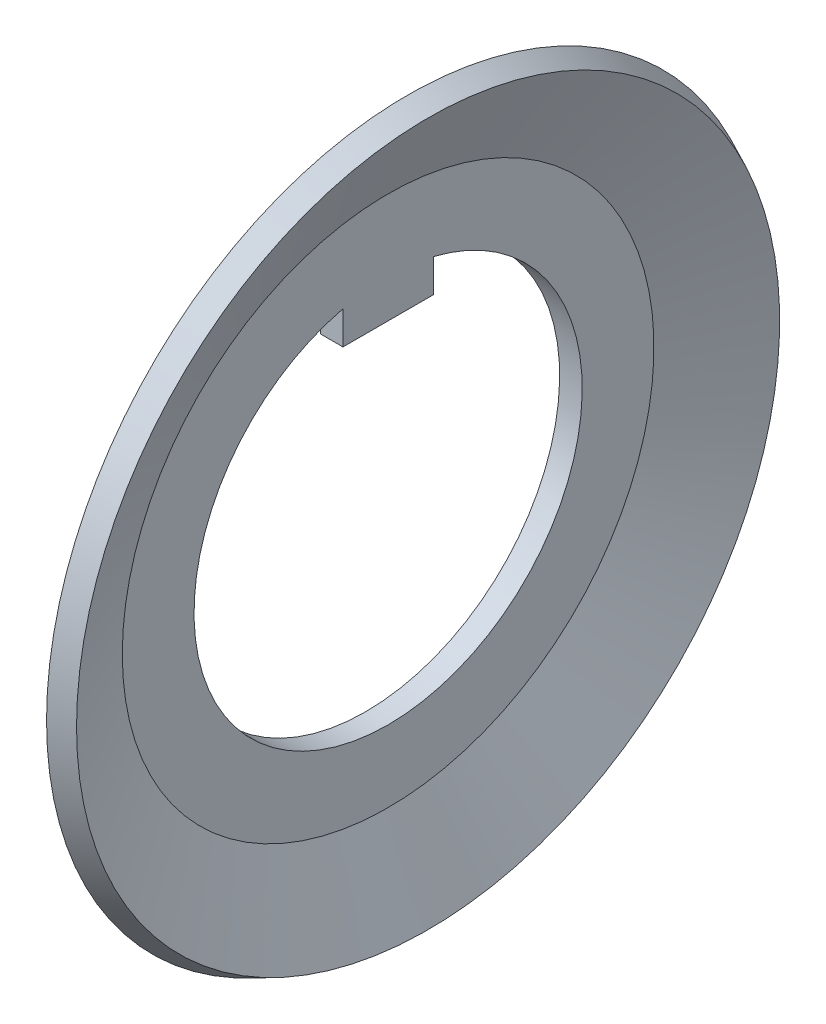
ISO-10303-21;
HEADER;
FILE_DESCRIPTION(('STEP AP214'),'2;1');
FILE_NAME('part.step','',(''),(''),'','','');
FILE_SCHEMA(('AUTOMOTIVE_DESIGN { 1 0 10303 214 1 1 1 1 }'));
ENDSEC;
DATA;
#1=APPLICATION_CONTEXT('core data for automotive mechanical design processes');
#2=APPLICATION_PROTOCOL_DEFINITION('international standard','automotive_design',2000,#1);
#3=PRODUCT_CONTEXT('',#1,'mechanical');
#4=PRODUCT('Part','Part','',(#3));
#5=PRODUCT_RELATED_PRODUCT_CATEGORY('part','',(#4));
#6=PRODUCT_DEFINITION_FORMATION('','',#4);
#7=PRODUCT_DEFINITION_CONTEXT('part definition',#1,'design');
#8=PRODUCT_DEFINITION('design','',#6,#7);
#9=PRODUCT_DEFINITION_SHAPE('','',#8);
#10=(LENGTH_UNIT() NAMED_UNIT(*) SI_UNIT(.MILLI.,.METRE.));
#11=(NAMED_UNIT(*) PLANE_ANGLE_UNIT() SI_UNIT($,.RADIAN.));
#12=(NAMED_UNIT(*) SI_UNIT($,.STERADIAN.) SOLID_ANGLE_UNIT());
#13=UNCERTAINTY_MEASURE_WITH_UNIT(LENGTH_MEASURE(1.E-05),#10,'distance_accuracy_value','');
#14=(GEOMETRIC_REPRESENTATION_CONTEXT(3) GLOBAL_UNCERTAINTY_ASSIGNED_CONTEXT((#13)) GLOBAL_UNIT_ASSIGNED_CONTEXT((#10,
#11,#12)) REPRESENTATION_CONTEXT('',''));
#15=CARTESIAN_POINT('',(0.,0.,0.));
#16=DIRECTION('',(0.,0.,1.));
#17=DIRECTION('',(1.,0.,0.));
#18=AXIS2_PLACEMENT_3D('',#15,#16,#17);
#19=CARTESIAN_POINT('',(0.,0.,0.));
#20=DIRECTION('',(-1.,0.,0.));
#21=DIRECTION('',(0.,0.,1.));
#22=AXIS2_PLACEMENT_3D('',#19,#20,#21);
#23=CYLINDRICAL_SURFACE('',#22,8.6);
#24=CARTESIAN_POINT('',(1.,0.,0.));
#25=DIRECTION('',(-1.,0.,0.));
#26=DIRECTION('',(0.,0.,1.));
#27=AXIS2_PLACEMENT_3D('',#24,#25,#26);
#28=CIRCLE('',#27,8.6);
#29=CARTESIAN_POINT('',(1.,8.36420946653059,-2.));
#30=VERTEX_POINT('',#29);
#31=CARTESIAN_POINT('',(1.,8.36420946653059,2.));
#32=VERTEX_POINT('',#31);
#33=EDGE_CURVE('E11',#30,#32,#28,.T.);
#34=ORIENTED_EDGE('',*,*,#33,.F.);
#35=DIRECTION('',(-1.,0.,0.));
#36=VECTOR('',#35,1.);
#37=CARTESIAN_POINT('',(0.,8.36420946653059,-2.));
#38=LINE('',#37,#36);
#39=CARTESIAN_POINT('',(0.,8.36420946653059,-2.));
#40=VERTEX_POINT('',#39);
#41=EDGE_CURVE('E101',#30,#40,#38,.T.);
#42=ORIENTED_EDGE('',*,*,#41,.T.);
#43=CARTESIAN_POINT('',(0.,0.,0.));
#44=DIRECTION('',(-1.,0.,0.));
#45=DIRECTION('',(0.,0.,1.));
#46=AXIS2_PLACEMENT_3D('',#43,#44,#45);
#47=CIRCLE('',#46,8.6);
#48=CARTESIAN_POINT('',(0.,8.36420946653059,2.));
#49=VERTEX_POINT('',#48);
#50=EDGE_CURVE('E74',#40,#49,#47,.T.);
#51=ORIENTED_EDGE('',*,*,#50,.T.);
#52=DIRECTION('',(-1.,0.,0.));
#53=VECTOR('',#52,1.);
#54=CARTESIAN_POINT('',(0.,8.36420946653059,2.));
#55=LINE('',#54,#53);
#56=EDGE_CURVE('E47',#49,#32,#55,.F.);
#57=ORIENTED_EDGE('',*,*,#56,.T.);
#58=EDGE_LOOP('',(#34,#42,#51,#57));
#59=FACE_BOUND('',#58,.T.);
#60=ADVANCED_FACE('F30',(#59),#23,.F.);
#61=CARTESIAN_POINT('',(1.,11.7783053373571,0.));
#62=DIRECTION('',(-1.,0.,0.));
#63=DIRECTION('',(0.,0.,1.));
#64=AXIS2_PLACEMENT_3D('',#61,#62,#63);
#65=PLANE('',#64);
#66=ORIENTED_EDGE('',*,*,#33,.T.);
#67=DIRECTION('',(0.,1.,0.));
#68=VECTOR('',#67,1.);
#69=CARTESIAN_POINT('',(1.,9.68898822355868,2.));
#70=LINE('',#69,#68);
#71=CARTESIAN_POINT('',(1.,6.9,2.));
#72=VERTEX_POINT('',#71);
#73=EDGE_CURVE('E86',#72,#32,#70,.T.);
#74=ORIENTED_EDGE('',*,*,#73,.F.);
#75=DIRECTION('',(0.,0.,1.));
#76=VECTOR('',#75,1.);
#77=CARTESIAN_POINT('',(1.,6.9,-2.));
#78=LINE('',#77,#76);
#79=CARTESIAN_POINT('',(1.,6.9,-2.));
#80=VERTEX_POINT('',#79);
#81=EDGE_CURVE('E95',#80,#72,#78,.T.);
#82=ORIENTED_EDGE('',*,*,#81,.F.);
#83=DIRECTION('',(0.,-1.,0.));
#84=VECTOR('',#83,1.);
#85=CARTESIAN_POINT('',(1.,9.68898822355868,-2.));
#86=LINE('',#85,#84);
#87=EDGE_CURVE('E81',#30,#80,#86,.T.);
#88=ORIENTED_EDGE('',*,*,#87,.F.);
#89=EDGE_LOOP('',(#66,#74,#82,#88));
#90=FACE_BOUND('',#89,.T.);
#91=CARTESIAN_POINT('',(1.,0.,0.));
#92=DIRECTION('',(-1.,0.,0.));
#93=DIRECTION('',(0.,0.,1.));
#94=AXIS2_PLACEMENT_3D('',#91,#92,#93);
#95=CIRCLE('',#94,11.7783053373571);
#96=CARTESIAN_POINT('',(1.,0.,11.7783053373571));
#97=VERTEX_POINT('',#96);
#98=EDGE_CURVE('E37',#97,#97,#95,.T.);
#99=ORIENTED_EDGE('',*,*,#98,.F.);
#100=EDGE_LOOP('',(#99));
#101=FACE_BOUND('',#100,.T.);
#102=ADVANCED_FACE('F117',(#90,#101),#65,.F.);
#103=CARTESIAN_POINT('',(1.,0.,0.));
#104=DIRECTION('',(1.,0.,0.));
#105=DIRECTION('',(0.,0.,-1.));
#106=AXIS2_PLACEMENT_3D('',#103,#104,#105);
#107=CONICAL_SURFACE('',#106,11.7783053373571,1.13446401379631);
#108=CARTESIAN_POINT('',(2.77153841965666,0.,0.));
#109=DIRECTION('',(-1.,0.,0.));
#110=DIRECTION('',(0.,0.,1.));
#111=AXIS2_PLACEMENT_3D('',#108,#109,#110);
#112=CIRCLE('',#111,15.5773817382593);
#113=CARTESIAN_POINT('',(2.77153841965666,0.,15.5773817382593));
#114=VERTEX_POINT('',#113);
#115=EDGE_CURVE('E110',#114,#114,#112,.T.);
#116=ORIENTED_EDGE('',*,*,#115,.F.);
#117=EDGE_LOOP('',(#116));
#118=FACE_BOUND('',#117,.T.);
#119=ORIENTED_EDGE('',*,*,#98,.T.);
#120=EDGE_LOOP('',(#119));
#121=FACE_BOUND('',#120,.T.);
#122=ADVANCED_FACE('F115',(#118,#121),#107,.F.);
#123=CARTESIAN_POINT('',(2.77153841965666,0.,0.));
#124=DIRECTION('',(-1.,0.,0.));
#125=DIRECTION('',(0.,0.,1.));
#126=AXIS2_PLACEMENT_3D('',#123,#124,#125);
#127=CONICAL_SURFACE('',#126,15.5773817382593,0.436332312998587);
#128=CARTESIAN_POINT('',(1.86523063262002,0.,0.));
#129=DIRECTION('',(-1.,0.,0.));
#130=DIRECTION('',(0.,0.,1.));
#131=AXIS2_PLACEMENT_3D('',#128,#129,#130);
#132=CIRCLE('',#131,16.);
#133=CARTESIAN_POINT('',(1.86523063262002,0.,16.));
#134=VERTEX_POINT('',#133);
#135=EDGE_CURVE('E107',#134,#134,#132,.T.);
#136=ORIENTED_EDGE('',*,*,#135,.F.);
#137=EDGE_LOOP('',(#136));
#138=FACE_BOUND('',#137,.T.);
#139=ORIENTED_EDGE('',*,*,#115,.T.);
#140=EDGE_LOOP('',(#139));
#141=FACE_BOUND('',#140,.T.);
#142=ADVANCED_FACE('F124',(#138,#141),#127,.T.);
#143=CARTESIAN_POINT('',(1.86523063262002,0.,0.));
#144=DIRECTION('',(1.,0.,0.));
#145=DIRECTION('',(0.,0.,-1.));
#146=AXIS2_PLACEMENT_3D('',#143,#144,#145);
#147=CONICAL_SURFACE('',#146,16.,1.13446401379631);
#148=CARTESIAN_POINT('',(0.,0.,0.));
#149=DIRECTION('',(-1.,0.,0.));
#150=DIRECTION('',(0.,0.,1.));
#151=AXIS2_PLACEMENT_3D('',#148,#149,#150);
#152=CIRCLE('',#151,12.);
#153=CARTESIAN_POINT('',(0.,0.,12.));
#154=VERTEX_POINT('',#153);
#155=EDGE_CURVE('E104',#154,#154,#152,.T.);
#156=ORIENTED_EDGE('',*,*,#155,.F.);
#157=EDGE_LOOP('',(#156));
#158=FACE_BOUND('',#157,.T.);
#159=ORIENTED_EDGE('',*,*,#135,.T.);
#160=EDGE_LOOP('',(#159));
#161=FACE_BOUND('',#160,.T.);
#162=ADVANCED_FACE('F130',(#158,#161),#147,.T.);
#163=CARTESIAN_POINT('',(0.,8.6,0.));
#164=DIRECTION('',(1.,0.,0.));
#165=DIRECTION('',(0.,0.,-1.));
#166=AXIS2_PLACEMENT_3D('',#163,#164,#165);
#167=PLANE('',#166);
#168=ORIENTED_EDGE('',*,*,#50,.F.);
#169=DIRECTION('',(0.,-1.,0.));
#170=VECTOR('',#169,1.);
#171=CARTESIAN_POINT('',(0.,9.68898822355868,-2.));
#172=LINE('',#171,#170);
#173=CARTESIAN_POINT('',(0.,6.9,-2.));
#174=VERTEX_POINT('',#173);
#175=EDGE_CURVE('E67',#40,#174,#172,.T.);
#176=ORIENTED_EDGE('',*,*,#175,.T.);
#177=DIRECTION('',(0.,0.,1.));
#178=VECTOR('',#177,1.);
#179=CARTESIAN_POINT('',(0.,6.9,-2.));
#180=LINE('',#179,#178);
#181=CARTESIAN_POINT('',(0.,6.9,2.));
#182=VERTEX_POINT('',#181);
#183=EDGE_CURVE('E73',#174,#182,#180,.T.);
#184=ORIENTED_EDGE('',*,*,#183,.T.);
#185=DIRECTION('',(0.,1.,0.));
#186=VECTOR('',#185,1.);
#187=CARTESIAN_POINT('',(0.,9.68898822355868,2.));
#188=LINE('',#187,#186);
#189=EDGE_CURVE('E90',#182,#49,#188,.T.);
#190=ORIENTED_EDGE('',*,*,#189,.T.);
#191=EDGE_LOOP('',(#168,#176,#184,#190));
#192=FACE_BOUND('',#191,.T.);
#193=ORIENTED_EDGE('',*,*,#155,.T.);
#194=EDGE_LOOP('',(#193));
#195=FACE_BOUND('',#194,.T.);
#196=ADVANCED_FACE('F69',(#192,#195),#167,.F.);
#197=CARTESIAN_POINT('',(1.,9.68898822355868,-2.));
#198=DIRECTION('',(0.,0.,-1.));
#199=DIRECTION('',(0.,1.,0.));
#200=AXIS2_PLACEMENT_3D('',#197,#198,#199);
#201=PLANE('',#200);
#202=ORIENTED_EDGE('',*,*,#41,.F.);
#203=ORIENTED_EDGE('',*,*,#87,.T.);
#204=DIRECTION('',(-1.,0.,0.));
#205=VECTOR('',#204,1.);
#206=CARTESIAN_POINT('',(1.,6.9,-2.));
#207=LINE('',#206,#205);
#208=EDGE_CURVE('E78',#80,#174,#207,.T.);
#209=ORIENTED_EDGE('',*,*,#208,.T.);
#210=ORIENTED_EDGE('',*,*,#175,.F.);
#211=EDGE_LOOP('',(#202,#203,#209,#210));
#212=FACE_BOUND('',#211,.T.);
#213=ADVANCED_FACE('F79',(#212),#201,.T.);
#214=CARTESIAN_POINT('',(1.,9.68898822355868,2.));
#215=DIRECTION('',(0.,0.,1.));
#216=DIRECTION('',(0.,-1.,0.));
#217=AXIS2_PLACEMENT_3D('',#214,#215,#216);
#218=PLANE('',#217);
#219=ORIENTED_EDGE('',*,*,#56,.F.);
#220=ORIENTED_EDGE('',*,*,#189,.F.);
#221=DIRECTION('',(-1.,0.,0.));
#222=VECTOR('',#221,1.);
#223=CARTESIAN_POINT('',(1.,6.9,2.));
#224=LINE('',#223,#222);
#225=EDGE_CURVE('E85',#72,#182,#224,.T.);
#226=ORIENTED_EDGE('',*,*,#225,.F.);
#227=ORIENTED_EDGE('',*,*,#73,.T.);
#228=EDGE_LOOP('',(#219,#220,#226,#227));
#229=FACE_BOUND('',#228,.T.);
#230=ADVANCED_FACE('F139',(#229),#218,.T.);
#231=CARTESIAN_POINT('',(1.,6.9,-2.));
#232=DIRECTION('',(0.,-1.,0.));
#233=DIRECTION('',(0.,0.,-1.));
#234=AXIS2_PLACEMENT_3D('',#231,#232,#233);
#235=PLANE('',#234);
#236=ORIENTED_EDGE('',*,*,#183,.F.);
#237=ORIENTED_EDGE('',*,*,#208,.F.);
#238=ORIENTED_EDGE('',*,*,#81,.T.);
#239=ORIENTED_EDGE('',*,*,#225,.T.);
#240=EDGE_LOOP('',(#236,#237,#238,#239));
#241=FACE_BOUND('',#240,.T.);
#242=ADVANCED_FACE('F88',(#241),#235,.T.);
#243=CLOSED_SHELL('',(#60,#102,#122,#142,#162,#196,#213,#230,#242));
#244=MANIFOLD_SOLID_BREP('B2',#243);
#245=ADVANCED_BREP_SHAPE_REPRESENTATION('',(#18,#244),#14);
#246=SHAPE_DEFINITION_REPRESENTATION(#9,#245);
ENDSEC;
END-ISO-10303-21;
